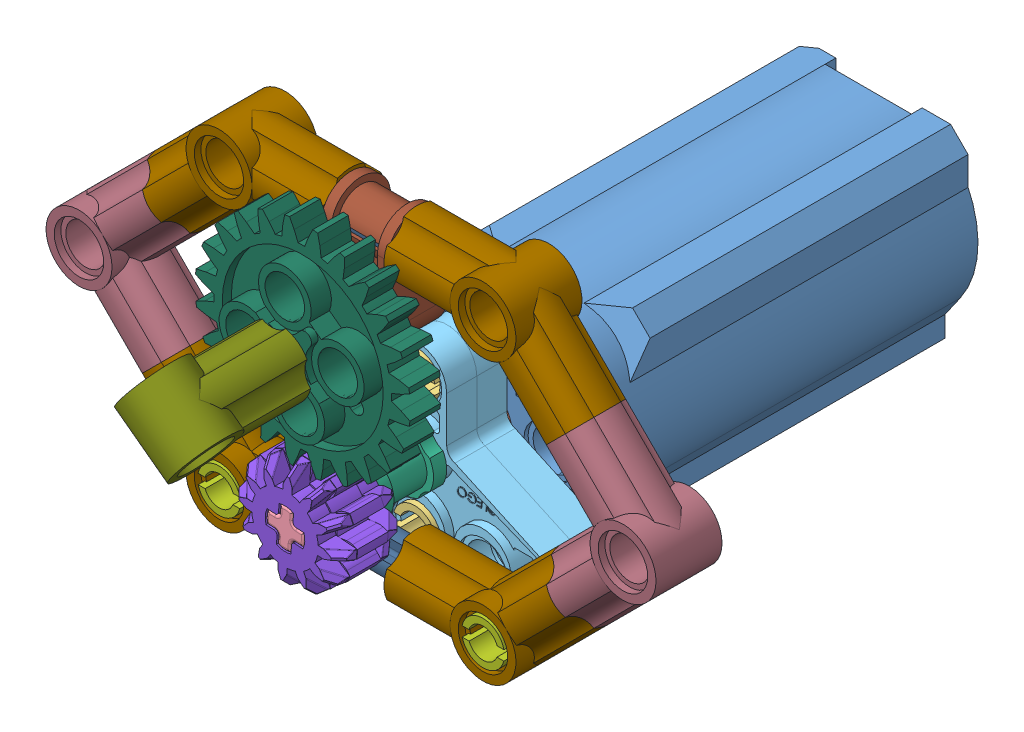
SolidWorks assembly 32.SLDASM, configuration 기본 (file format 9000). Lengths in mm.
Overall size (77.25 55.6 88.8).
27 component instances, 16 part files, 73 mates.
Components (placement in the parent):
- 9V Motor M-1: 9V Motor M.SLDPRT [기본] at (-8.1378 -0.8845 48.1336) size (24 24 48.27)
- Motor 9V  PF Medium part-1: Motor 9V  PF Medium part.SLDPRT [기본] at (-6.1901 -1.5663 64.1336) x (0.997456 -0.07129 0) z (0 0 1) size (7 7 8)
- 2780 Pin with Friction Ridges Lengthwise WITH Center Slots-1: 2780 Pin with Friction Ridges Lengthwise WITH Center Slots.SLDPRT [기본] at (-8.1378 -8.8845 72.4336) x (1 0 0) z (0 -1 0) size (6 16 5.88)
- 3705 Axle 4-1: 3705 Axle 4.SLDPRT [기본] at (-8.1378 -0.8845 96.1336) x (0.997456 -0.07129 0) z (0.07129 0.997456 0) size (4.8 32.01 4.8)
- 2780 Pin with Friction Ridges Lengthwise WITH Center Slots-2: 2780 Pin with Friction Ridges Lengthwise WITH Center Slots.SLDPRT [기본] at (-8.2078 7.1155 72.4336) x (1 0 0) z (0 1 0) size (6 16 5.88)
- 2905 Liftarm Triangle Thin-1: 2905 Liftarm Triangle Thin.SLDPRT [기본] at (-8.1378 -12.4845 74.6586) x (1 0 0) z (0 -1 0) size (39.2 3.65 23.2)
- 2905 Liftarm Triangle Thin-2: 2905 Liftarm Triangle Thin.SLDPRT [기본] at (-8.1378 -12.4845 78.3086) x (1 0 0) z (0 -1 0) size (39.2 3.65 23.2)
- 3713 Bush-1: 3713 Bush.SLDPRT [기본] at (-8.1378 -0.8845 84.1336) x (1 0 0) z (0 1 0) size (7.2 8.01 7.2)
- 43093 Axle Pin with Friction Ridges Lengthwise-1: 43093 Axle Pin with Friction Ridges Lengthwise.SLDPRT [기본] at (-24.1378 -8.8845 80.1336) x (1 0 0) z (0 1 0) size (6 16 6)
- 43093 Axle Pin with Friction Ridges Lengthwise-2: 43093 Axle Pin with Friction Ridges Lengthwise.SLDPRT [기본] at (7.8622 -8.8845 80.1336) x (1 0 0) z (0 1 0) size (6 16 6)
- 32270 Gear 12 Tooth Double Bevel-1: 32270 Gear 12 Tooth Double Bevel.SLDPRT [기본] at (-8.1378 -0.8845 92.1336) x (0.997456 -0.07129 0) z (0.07129 0.997456 0) size (13.27 8.11 13.27)
- 32192 Axle Pin Connector Angled #4-1: 32192 Axle Pin Connector Angled #4.SLDPRT [기본] at (-12.1378 -8.8845 84.1336) size (23.31 15.31 8)
- 4519 Axle 3-1: 4519 Axle 3.SLDPRT [기본] at (-20.1378 -8.8845 84.1336) x (0 -1 0) z (0 0 1) size (4.8 24.01 4.8)
- 6536 Axle and Pin Connector Perpendicular-1: 6536 Axle and Pin Connector Perpendicular.SLDPRT [기본] at (-8.1378 25.0566 84.1336) x (0 1 0) z (0 0 -1) size (15.2 8 8)
- 32192 Axle Pin Connector Angled #4-2: 32192 Axle Pin Connector Angled #4.SLDPRT [기본] at (16.3475 -0.3993 84.1336) x (0.707107 0.707107 0) z (0 0 1) size (23.31 15.31 8)
- 32062 Axle 2 Notched-1: 32062 Axle 2 Notched.SLDPRT [기본] at (22.0043 10.9144 84.1336) x (0.707107 0.707107 0) z (0 0 1) size (4.8 16.01 4.8)
- 32014 Axle Pin Connector Angled #6-1: 32014 Axle Pin Connector Angled #6.SLDPRT [기본] at (-32.6231 -0.3993 84.1336) x (0.707107 -0.707107 0) z (0 0 1) size (16 16 8)
- 32014 Axle Pin Connector Angled #6-2: 32014 Axle Pin Connector Angled #6.SLDPRT [기본] at (16.3475 16.5713 84.1336) x (-0.707107 0.707107 0) z (0 0 1) size (16 16 8)
- 32062 Axle 2 Notched-2: 32062 Axle 2 Notched.SLDPRT [기본] at (10.6906 -6.0561 84.1336) x (0.707107 -0.707107 0) z (0 0 1) size (4.8 16.01 4.8)
- 32062 Axle 2 Notched-3: 32062 Axle 2 Notched.SLDPRT [기본] at (-26.9662 -6.0561 84.1336) x (0.707107 0.707107 0) z (0 0 1) size (4.8 16.01 4.8)
- 32062 Axle 2 Notched-4: 32062 Axle 2 Notched.SLDPRT [기본] at (-38.2799 10.9144 84.1336) x (0.707107 -0.707107 0) z (0 0 1) size (4.8 16.01 4.8)
- 32192 Axle Pin Connector Angled #4-3: 32192 Axle Pin Connector Angled #4.SLDPRT [기본] at (-4.1378 25.0566 84.1336) x (-1 0 0) z (0 0 1) size (23.31 15.31 8)
- 32192 Axle Pin Connector Angled #4-4: 32192 Axle Pin Connector Angled #4.SLDPRT [기본] at (-32.6231 16.5713 84.1336) x (-0.707107 -0.707107 0) z (0 0 1) size (23.31 15.31 8)
- 4519 Axle 3-2: 4519 Axle 3.SLDPRT [기본] at (-20.1378 25.0566 84.1336) x (0 -1 0) z (0 0 1) size (4.8 24.01 4.8)
- 6587 Axle3 w stud-1: 6587 Axle3 w stud.SLDPRT [기본] at (-8.1378 17.0566 80.9336) x (-0.802197 0.597059 0) z (0.597059 0.802197 0) size (6 26.4 6)
- 3648 Gear 24-1: 3648 Gear 24.SLDPRT [기본] at (-8.1378 17.0566 92.1336) x (-0.802197 0.597059 0) z (-0.597059 -0.802197 0) size (26.1 8 26.1)
- 32013 Axle pin connector angled #1-1: 32013 Axle pin connector angled #1.SLDPRT [기본] at (-8.1378 17.0566 96.9336) x (0 0 -1) z (-0.802197 0.597059 0) size (16 8 8)
Mates (geometry in assembly coordinates):
- 동심1: concentric anti-aligned: cylinder of 9V Motor M-1 through (-8.1378 -0.8845 72.1336) axis (0 0 1) radius 3.505; cylinder of Motor 9V  PF Medium part-1 through (-8.1388 -0.8842 72.1308) axis (0.00018 -0.000029 -1) radius 3.5
- 일치1: coincident aligned: plane of 9V Motor M-1 through (-8.1378 -0.8845 72.1336) normal (0 0 1); plane of Motor 9V  PF Medium part-1 through (-8.1388 -0.8842 72.1308) normal (-0.00018 0.000029 1)
- 동심4: concentric aligned: cylinder of 9V Motor M-1 through (-8.1378 -8.8845 72.1336) axis (0 0 1) radius 2.4; cylinder of 2780 Pin with Friction Ridges Lengthwise WITH Center Slots-1 through (-8.1378 -8.8845 64.4336) axis (0 0 1) radius 2.4
- 일치5: coincident anti-aligned: plane of 9V Motor M-1 through (-5.7378 -8.8845 71.6336) normal (0 0 1); plane of 2780 Pin with Friction Ridges Lengthwise WITH Center Slots-1 through (-8.1378 -8.8845 71.6336) normal (0 0 -1)
- 동심5: concentric anti-aligned: cylinder of 9V Motor M-1 through (-8.2078 7.1155 72.1336) axis (0 0 1) radius 2.4; cylinder of 2780 Pin with Friction Ridges Lengthwise WITH Center Slots-2 through (-8.2078 7.1155 80.4336) axis (0 0 -1) radius 2.4
- 일치6: coincident anti-aligned: plane of 9V Motor M-1 through (-5.8078 7.1155 71.6336) normal (0 0 1); plane of 2780 Pin with Friction Ridges Lengthwise WITH Center Slots-2 through (-8.2078 7.1155 71.6336) normal (0 0 -1)
- 동심6: concentric anti-aligned: cylinder of Motor 9V  PF Medium part-1 through (-8.1388 -0.8842 72.1308) axis (0.00018 -0.000029 -1) radius 2.4; cylinder of 3705 Axle 4-1 through (-8.1495 -0.9039 64.1457) axis (0.000585 0.000396 1) radius 2.4
- 일치7: coincident anti-aligned: plane of Motor 9V  PF Medium part-1 through (-10.5385 -0.9257 72.1304) normal (0.350558 0.936541 0.000035); plane of 3705 Axle 4-1 through (-10.5492 -0.9449 64.1471) normal (-0.350728 -0.936477 0.000576)
- 일치8: coincident aligned: circle of Motor 9V  PF Medium part-1; plane of 3705 Axle 4-1 through (-8.1495 -0.9039 64.1457) normal (-0.000585 -0.000396 -1)
- 동심7: concentric aligned: cylinder of 2780 Pin with Friction Ridges Lengthwise WITH Center Slots-1 through (-8.1378 -8.8845 64.4336) axis (0 0 1) radius 2.4; cylinder of 2905 Liftarm Triangle Thin-1 through (-8.1378 -8.8845 72.8336) axis (0 0 1) radius 2.4
- 동심8: concentric aligned: cylinder of 3705 Axle 4-1 through (-8.1495 -0.9039 64.1457) axis (0.000585 0.000396 1) radius 2.4; cylinder of 2905 Liftarm Triangle Thin-1 through (-8.1378 -0.8845 72.8336) axis (0 0 1) radius 2.4
- 일치9: coincident anti-aligned: plane of 2780 Pin with Friction Ridges Lengthwise WITH Center Slots-1 through (-8.1378 -8.8845 73.2336) normal (0 0 1); plane of 2905 Liftarm Triangle Thin-1 through (-10.5378 -8.8845 73.2336) normal (0 0 -1)
- 동심9: concentric aligned: cylinder of 2780 Pin with Friction Ridges Lengthwise WITH Center Slots-1 through (-8.1378 -8.8845 64.4336) axis (0 0 1) radius 2.4; cylinder of 2905 Liftarm Triangle Thin-2 through (-8.1378 -8.8845 76.4836) axis (0 0 1) radius 2.4
- 동심10: concentric aligned: cylinder of 3705 Axle 4-1 through (-8.1495 -0.9039 64.1457) axis (0.000585 0.000396 1) radius 2.4; cylinder of 2905 Liftarm Triangle Thin-2 through (-8.1378 -0.8845 76.4836) axis (0 0 1) radius 2.4
- 일치10: coincident anti-aligned: plane of 2905 Liftarm Triangle Thin-1 through (-24.0128 -8.3632 76.4836) normal (0 0 1); plane of 2905 Liftarm Triangle Thin-2 through (-24.0128 -8.3632 76.4836) normal (0 0 -1)
- 동심11: concentric anti-aligned: cylinder of 3705 Axle 4-1 through (-8.1495 -0.9039 64.1457) axis (0.000585 0.000396 1) radius 2.4; cylinder of 3713 Bush-1 through (-8.1378 -0.8845 88.1334) axis (-0.000013 -0.000002 -1) radius 2.4
- 일치11: coincident anti-aligned: plane of 2905 Liftarm Triangle Thin-2 through (-24.0128 -8.3632 80.1336) normal (0 0 1); plane of 3713 Bush-1 through (-8.1379 -0.8846 80.1334) normal (-0.000013 -0.000002 -1)
- 동심12: concentric aligned: cylinder of 2905 Liftarm Triangle Thin-1 through (-24.1378 -8.8845 72.8336) axis (0 0 1) radius 2.4; cylinder of 43093 Axle Pin with Friction Ridges Lengthwise-1 through (-24.1378 -8.8845 72.1336) axis (0 0 1) radius 2.4
- 일치12: coincident anti-aligned: plane of 2905 Liftarm Triangle Thin-1 through (-23.2578 -8.0045 72.8336) normal (0 -1 0); plane of 43093 Axle Pin with Friction Ridges Lengthwise-1 through (-22.8578 -8.0045 72.1336) normal (0 1 0)
- 일치13: coincident anti-aligned: plane of 2905 Liftarm Triangle Thin-2 through (-24.0128 -8.3632 80.1336) normal (0 0 1); plane of 43093 Axle Pin with Friction Ridges Lengthwise-1 through (-24.1378 -8.8845 80.1336) normal (0 0 -1)
- 동심13: concentric aligned: cylinder of 2905 Liftarm Triangle Thin-2 through (7.8622 -8.8845 76.4836) axis (0 0 1) radius 2.4; cylinder of 43093 Axle Pin with Friction Ridges Lengthwise-2 through (7.8622 -8.8845 72.1336) axis (0 0 1) radius 2.4
- 일치14: coincident anti-aligned: plane of 2905 Liftarm Triangle Thin-2 through (10.095 -8.0045 76.4836) normal (0 -1 0); plane of 43093 Axle Pin with Friction Ridges Lengthwise-2 through (9.1422 -8.0045 72.1336) normal (0 1 0)
- 일치15: coincident anti-aligned: plane of 2905 Liftarm Triangle Thin-2 through (-24.0128 -8.3632 80.1336) normal (0 0 1); plane of 43093 Axle Pin with Friction Ridges Lengthwise-2 through (7.8622 -8.8845 80.1336) normal (0 0 -1)
- 동심14: concentric anti-aligned: cylinder of 3705 Axle 4-1 through (-8.1495 -0.9039 64.1457) axis (0.000585 0.000396 1) radius 2.4; cylinder of 32270 Gear 12 Tooth Double Bevel-1 through (-8.14 -0.8831 96.1905) axis (-0.000116 -0.000386 -1) radius 2.4
- 일치16: coincident anti-aligned: plane of 3705 Axle 4-1 through (-8.665 0.2288 64.1455) normal (0.350728 0.936477 -0.000576); plane of 32270 Gear 12 Tooth Double Bevel-1 through (-9.0301 0.3899 96.1901) normal (-0.350715 -0.936482 0.000402)
- 일치17: coincident anti-aligned: plane of 3713 Bush-1 through (-8.1378 -0.8845 88.1334) normal (0.000013 0.000002 1); plane of 32270 Gear 12 Tooth Double Bevel-1 through (-8.141 -0.8862 88.133) normal (-0.000116 -0.000386 -1)
- 동심15: concentric anti-aligned: cylinder of 43093 Axle Pin with Friction Ridges Lengthwise-1 through (-24.1378 -8.8845 88.1336) axis (0 0 -1) radius 2.4; cylinder of 32192 Axle Pin Connector Angled #4-1 through (-24.1378 -8.8845 80.1336) axis (0 0 1) radius 2.4
- 동심16: concentric anti-aligned: cylinder of 43093 Axle Pin with Friction Ridges Lengthwise-2 through (7.8622 -8.8845 88.1336) axis (0 0 -1) radius 2.4; cylinder of 32192 Axle Pin Connector Angled #4-2 through (7.8622 -8.8845 80.1336) axis (0 0 1) radius 2.4
- 동심17: concentric anti-aligned: cylinder of 32192 Axle Pin Connector Angled #4-1 through (-28.1388 -8.8845 84.1336) axis (1 0 0) radius 2.4; cylinder of 4519 Axle 3-1 through (3.8622 -8.8845 84.1336) axis (-1 0 0) radius 2.4
- 일치18: coincident anti-aligned: plane of 32192 Axle Pin Connector Angled #4-1 through (-28.1388 -8.0045 85.0136) normal (0 -1 0); plane of 4519 Axle 3-1 through (3.8622 -8.0045 85.0136) normal (0 1 0)
- 동심18: concentric aligned: cylinder of 4519 Axle 3-1 through (3.8622 -8.8845 84.1336) axis (-1 0 0) radius 2.4; cylinder of 32192 Axle Pin Connector Angled #4-2 through (19.1773 -8.8845 84.1336) axis (-1 0 0) radius 2.4
- 일치19: coincident anti-aligned: plane of 4519 Axle 3-1 through (3.8622 -8.0045 85.0136) normal (0 1 0); plane of 32192 Axle Pin Connector Angled #4-2 through (19.1773 -8.0045 86.3664) normal (0 -1 0)
- 탄젠트2: tangent anti-aligned: plane of 4519 Axle 3-1 through (3.8622 -8.8845 84.1336) normal (1 0 0); cylinder of 32192 Axle Pin Connector Angled #4-2 through (7.8622 -8.8845 80.1336) axis (0 0 1) radius 4
- 일치20: coincident anti-aligned: plane of 43093 Axle Pin with Friction Ridges Lengthwise-2 through (7.8622 -8.8845 80.9336) normal (0 0 1); plane of 32192 Axle Pin Connector Angled #4-2 through (9.5593 -7.1875 80.9336) normal (0 0 -1)
- 동심19: concentric anti-aligned: cylinder of 32192 Axle Pin Connector Angled #4-2 through (5.0331 -11.7137 84.1336) axis (0.707107 0.707107 0) radius 2.4; cylinder of 32062 Axle 2 Notched-2 through (22.0043 5.2576 84.1336) axis (-0.707107 -0.707107 0) radius 2.4
- 일치21: coincident anti-aligned: plane of 32192 Axle Pin Connector Angled #4-2 through (5.6553 -12.3359 83.2536) normal (-0.707107 0.707107 0); plane of 32062 Axle 2 Notched-2 through (22.6266 4.6353 83.2536) normal (0.707107 -0.707107 0)
- 탄젠트3: tangent anti-aligned: cylinder of 32192 Axle Pin Connector Angled #4-2 through (7.8622 -8.8845 80.1336) axis (0 0 1) radius 4; plane of 32062 Axle 2 Notched-2 through (10.6906 -6.0561 84.1336) normal (-0.707107 -0.707107 0)
- 동심20: concentric anti-aligned: cylinder of 32192 Axle Pin Connector Angled #4-1 through (-16.1368 -16.8855 84.1336) axis (-0.707107 0.707107 0) radius 2.4; cylinder of 32062 Axle 2 Notched-3 through (-38.2799 5.2576 84.1336) axis (0.707107 -0.707107 0) radius 2.4
- 일치22: coincident anti-aligned: plane of 32192 Axle Pin Connector Angled #4-1 through (-15.5145 -16.2633 86.3664) normal (-0.707107 -0.707107 0); plane of 32062 Axle 2 Notched-3 through (-37.6577 5.8798 86.3664) normal (0.707107 0.707107 0)
- 탄젠트5: tangent anti-aligned: cylinder of 32192 Axle Pin Connector Angled #4-1 through (-24.1378 -8.8845 80.1336) axis (0 0 1) radius 4; plane of 32062 Axle 2 Notched-3 through (-26.9662 -6.0561 84.1336) normal (0.707107 -0.707107 0)
- 동심21: concentric aligned: cylinder of 32014 Axle Pin Connector Angled #6-1 through (-43.9375 10.9152 84.1336) axis (0.707107 -0.707107 0) radius 2.4; cylinder of 32062 Axle 2 Notched-3 through (-38.2799 5.2576 84.1336) axis (0.707107 -0.707107 0) radius 2.4
- 일치23: coincident anti-aligned: plane of 32014 Axle Pin Connector Angled #6-1 through (-43.3152 11.5374 85.0136) normal (-0.707107 -0.707107 0); plane of 32062 Axle 2 Notched-3 through (-37.6577 5.8798 86.3664) normal (0.707107 0.707107 0)
- 탄젠트6: tangent anti-aligned: cylinder of 32014 Axle Pin Connector Angled #6-1 through (-41.1084 8.086 80.1336) axis (0 0 1) radius 4; plane of 32062 Axle 2 Notched-3 through (-38.2799 5.2576 84.1336) normal (-0.707107 0.707107 0)
- 동심22: concentric aligned: cylinder of 32014 Axle Pin Connector Angled #6-2 through (27.6619 10.9152 84.1336) axis (-0.707107 -0.707107 0) radius 2.4; cylinder of 32062 Axle 2 Notched-2 through (22.0043 5.2576 84.1336) axis (-0.707107 -0.707107 0) radius 2.4
- 일치24: coincident anti-aligned: plane of 32014 Axle Pin Connector Angled #6-2 through (27.0396 11.5374 86.3664) normal (0.707107 -0.707107 0); plane of 32062 Axle 2 Notched-2 through (21.3821 5.8798 85.0136) normal (-0.707107 0.707107 0)
- 일치25: coincident anti-aligned: plane of 32192 Axle Pin Connector Angled #4-2 through (17.7617 -1.8135 86.1336) normal (0.707107 0.707107 0); plane of 32014 Axle Pin Connector Angled #6-2 through (14.9333 1.015 86.1336) normal (-0.707107 -0.707107 0)
- 동심23: concentric anti-aligned: cylinder of 32062 Axle 2 Notched-1 through (10.6906 22.2282 84.1336) axis (0.707107 -0.707107 0) radius 2.4; cylinder of 32014 Axle Pin Connector Angled #6-2 through (27.6619 5.2569 84.1336) axis (-0.707107 0.707107 0) radius 2.4
- 일치26: coincident anti-aligned: plane of 32062 Axle 2 Notched-1 through (11.3129 22.8504 86.3664) normal (0.707107 0.707107 0); plane of 32014 Axle Pin Connector Angled #6-2 through (28.2842 5.8791 86.3664) normal (-0.707107 -0.707107 0)
- 탄젠트8: tangent anti-aligned: plane of 32062 Axle 2 Notched-1 through (22.0043 10.9144 84.1336) normal (0.707107 -0.707107 0); cylinder of 32014 Axle Pin Connector Angled #6-2 through (24.8328 8.086 80.1336) axis (0 0 1) radius 4
- 동심24: concentric anti-aligned: cylinder of 32014 Axle Pin Connector Angled #6-1 through (-43.9375 5.2569 84.1336) axis (0.707107 0.707107 0) radius 2.4; cylinder of 32062 Axle 2 Notched-4 through (-26.9662 22.2282 84.1336) axis (-0.707107 -0.707107 0) radius 2.4
- 일치27: coincident anti-aligned: plane of 32014 Axle Pin Connector Angled #6-1 through (-44.5598 5.8791 81.9007) normal (0.707107 -0.707107 0); plane of 32062 Axle 2 Notched-4 through (-27.5885 22.8504 81.9007) normal (-0.707107 0.707107 0)
- 탄젠트9: tangent anti-aligned: cylinder of 32014 Axle Pin Connector Angled #6-1 through (-41.1084 8.086 80.1336) axis (0 0 1) radius 4; plane of 32062 Axle 2 Notched-4 through (-38.2799 10.9144 84.1336) normal (-0.707107 -0.707107 0)
- 동심25: concentric aligned: cylinder of 32062 Axle 2 Notched-4 through (-26.9662 22.2282 84.1336) axis (-0.707107 -0.707107 0) radius 2.4; cylinder of 32192 Axle Pin Connector Angled #4-4 through (-21.3087 27.8857 84.1336) axis (-0.707107 -0.707107 0) radius 2.4
- 일치29: coincident anti-aligned: plane of 32062 Axle 2 Notched-4 through (-26.344 21.6059 86.3664) normal (0.707107 -0.707107 0); plane of 32192 Axle Pin Connector Angled #4-4 through (-20.6864 27.2635 85.0136) normal (-0.707107 0.707107 0)
- 탄젠트10: tangent anti-aligned: plane of 32062 Axle 2 Notched-4 through (-26.9662 22.2282 84.1336) normal (0.707107 0.707107 0); cylinder of 32192 Axle Pin Connector Angled #4-4 through (-24.1378 25.0566 80.1336) axis (0 0 1) radius 4
- 동심26: concentric aligned: cylinder of 32062 Axle 2 Notched-1 through (10.6906 22.2282 84.1336) axis (0.707107 -0.707107 0) radius 2.4; cylinder of 32192 Axle Pin Connector Angled #4-3 through (-0.1388 33.0576 84.1336) axis (0.707107 -0.707107 0) radius 2.4
- 일치30: coincident anti-aligned: plane of 32062 Axle 2 Notched-1 through (11.3129 22.8504 86.3664) normal (0.707107 0.707107 0); plane of 32192 Axle Pin Connector Angled #4-3 through (0.4835 33.6798 85.0136) normal (-0.707107 -0.707107 0)
- 탄젠트11: tangent anti-aligned: plane of 32062 Axle 2 Notched-1 through (10.6906 22.2282 84.1336) normal (-0.707107 0.707107 0); cylinder of 32192 Axle Pin Connector Angled #4-3 through (7.8622 25.0566 80.1336) axis (0 0 1) radius 4
- 동심27: concentric aligned: cylinder of 32192 Axle Pin Connector Angled #4-3 through (11.8632 25.0566 84.1336) axis (-1 0 0) radius 2.4; cylinder of 4519 Axle 3-2 through (3.8622 25.0566 84.1336) axis (-1 0 0) radius 2.4
- 동심28: concentric anti-aligned: cylinder of 32192 Axle Pin Connector Angled #4-4 through (-35.4529 25.0566 84.1336) axis (1 0 0) radius 2.4; cylinder of 4519 Axle 3-2 through (3.8622 25.0566 84.1336) axis (-1 0 0) radius 2.4
- 탄젠트12: tangent anti-aligned: cylinder of 32192 Axle Pin Connector Angled #4-4 through (-24.1378 25.0566 80.1336) axis (0 0 1) radius 4; plane of 4519 Axle 3-2 through (-20.1378 25.0566 84.1336) normal (-1 0 0)
- 일치31: coincident anti-aligned: plane of 32192 Axle Pin Connector Angled #4-4 through (-35.4529 25.9366 81.9007) normal (0 -1 0); plane of 4519 Axle 3-2 through (3.8622 25.9366 81.9007) normal (0 1 0)
- 동심29: concentric anti-aligned: cylinder of 6536 Axle and Pin Connector Perpendicular-1 through (-12.1378 25.0566 84.1336) axis (1 0 0) radius 2.4; cylinder of 4519 Axle 3-2 through (3.8622 25.0566 84.1336) axis (-1 0 0) radius 2.4
- 일치32: coincident anti-aligned: plane of 6536 Axle and Pin Connector Perpendicular-1 through (-12.1378 25.9366 85.4136) normal (0 -1 0); plane of 4519 Axle 3-2 through (3.8622 25.9366 85.0136) normal (0 1 0)
- 일치33: coincident anti-aligned: plane of 6536 Axle and Pin Connector Perpendicular-1 through (-4.1378 25.0566 84.1336) normal (1 0 0); plane of 32192 Axle Pin Connector Angled #4-3 through (-4.1378 27.0566 86.1336) normal (-1 0 0)
- 동심30: concentric aligned: cylinder of 6536 Axle and Pin Connector Perpendicular-1 through (-8.1378 17.0566 88.1336) axis (0 0 -1) radius 2.4; cylinder of 6587 Axle3 w stud-1 through (-8.1393 17.0593 104.9341) axis (0.00006 -0.000109 -1) radius 2.4
- 일치34: coincident anti-aligned: plane of 6536 Axle and Pin Connector Perpendicular-1 through (-8.1378 17.0566 80.9336) normal (0 0 -1); plane of 6587 Axle3 w stud-1 through (-8.1378 17.0567 80.9341) normal (-0.00006 0.000109 1)
- 동심31: concentric anti-aligned: cylinder of 6587 Axle3 w stud-1 through (-8.1393 17.0593 104.9341) axis (0.00006 -0.000109 -1) radius 2.4; cylinder of 3648 Gear 24-1 through (-8.1378 17.0566 88.1336) axis (-0.000084 0.00008 1) radius 2.4
- 일치35: coincident anti-aligned: plane of 6587 Axle3 w stud-1 through (-7.7653 15.8723 104.9342) normal (0.886903 -0.461955 0.000104); plane of 3648 Gear 24-1 through (-4.2531 22.6103 90.2785) normal (-0.886902 0.461958 -0.000111)
- 일치36: coincident anti-aligned: plane of 6536 Axle and Pin Connector Perpendicular-1 through (-8.1378 17.0566 88.1336) normal (0 0 1); plane of 3648 Gear 24-1 through (-6.4044 11.6855 88.1341) normal (0.000084 -0.00008 -1)
- 동심32: concentric aligned: cylinder of 6587 Axle3 w stud-1 through (-8.1393 17.0593 104.9341) axis (0.00006 -0.000109 -1) radius 2.4; cylinder of 32013 Axle pin connector angled #1-1 through (-8.1412 17.0589 112.9334) axis (0.000156 -0.000094 -1) radius 2.4
- 일치37: coincident anti-aligned: plane of 6587 Axle3 w stud-1 through (-9.9512 15.4855 104.9342) normal (-0.886903 0.461955 -0.000104); plane of 32013 Axle pin connector angled #1-1 through (-9.3282 16.685 112.9333) normal (0.886889 -0.461983 0.000181)
- 탄젠트13: tangent anti-aligned: plane of 6587 Axle3 w stud-1 through (-8.1393 17.0593 104.9341) normal (-0.00006 0.000109 1); cylinder of 32013 Axle pin connector angled #1-1 through (-6.2926 20.6061 108.9324) axis (-0.461983 -0.886889 0.000011) radius 4
